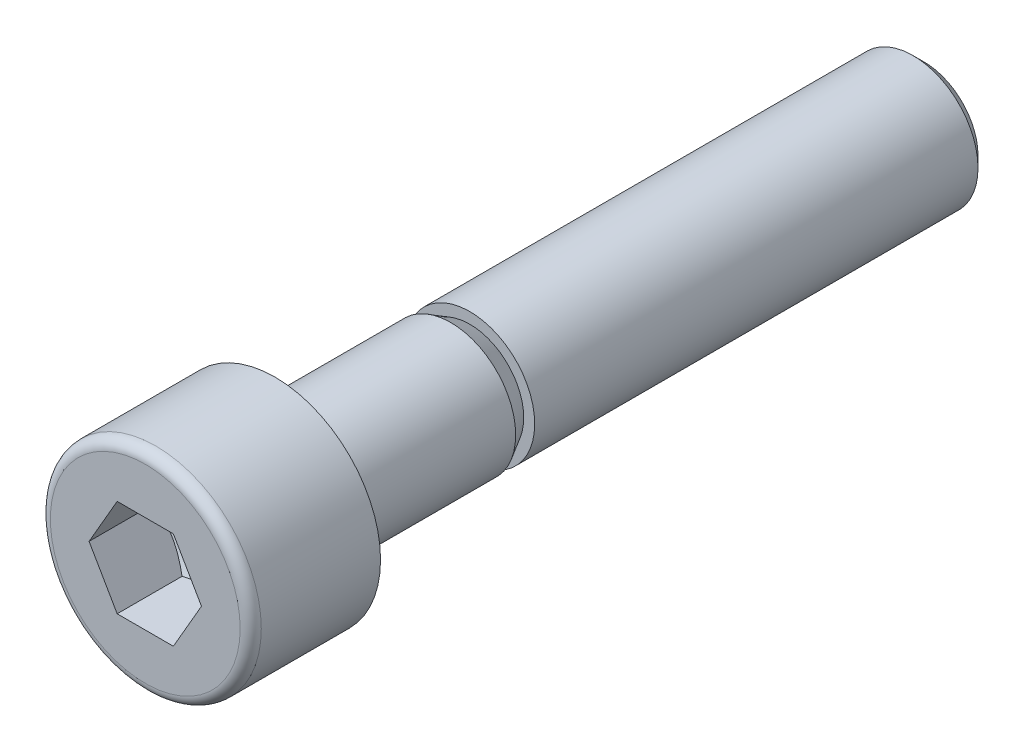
ISO-10303-21;
HEADER;
FILE_DESCRIPTION(('STEP AP214'),'2;1');
FILE_NAME('part.step','',(''),(''),'','','');
FILE_SCHEMA(('AUTOMOTIVE_DESIGN { 1 0 10303 214 1 1 1 1 }'));
ENDSEC;
DATA;
#1=APPLICATION_CONTEXT('core data for automotive mechanical design processes');
#2=APPLICATION_PROTOCOL_DEFINITION('international standard','automotive_design',2000,#1);
#3=PRODUCT_CONTEXT('',#1,'mechanical');
#4=PRODUCT('Part','Part','',(#3));
#5=PRODUCT_RELATED_PRODUCT_CATEGORY('part','',(#4));
#6=PRODUCT_DEFINITION_FORMATION('','',#4);
#7=PRODUCT_DEFINITION_CONTEXT('part definition',#1,'design');
#8=PRODUCT_DEFINITION('design','',#6,#7);
#9=PRODUCT_DEFINITION_SHAPE('','',#8);
#10=(LENGTH_UNIT() NAMED_UNIT(*) SI_UNIT(.MILLI.,.METRE.));
#11=(NAMED_UNIT(*) PLANE_ANGLE_UNIT() SI_UNIT($,.RADIAN.));
#12=(NAMED_UNIT(*) SI_UNIT($,.STERADIAN.) SOLID_ANGLE_UNIT());
#13=UNCERTAINTY_MEASURE_WITH_UNIT(LENGTH_MEASURE(1.E-05),#10,'distance_accuracy_value','');
#14=(GEOMETRIC_REPRESENTATION_CONTEXT(3) GLOBAL_UNCERTAINTY_ASSIGNED_CONTEXT((#13)) GLOBAL_UNIT_ASSIGNED_CONTEXT((#10,
#11,#12)) REPRESENTATION_CONTEXT('',''));
#15=CARTESIAN_POINT('',(0.,0.,0.));
#16=DIRECTION('',(0.,0.,1.));
#17=DIRECTION('',(1.,0.,0.));
#18=AXIS2_PLACEMENT_3D('',#15,#16,#17);
#19=CARTESIAN_POINT('',(0.,0.,8.));
#20=DIRECTION('',(0.,0.,1.));
#21=DIRECTION('',(1.,0.,0.));
#22=AXIS2_PLACEMENT_3D('',#19,#20,#21);
#23=PLANE('',#22);
#24=CARTESIAN_POINT('',(0.,0.,8.));
#25=DIRECTION('',(0.,0.,1.));
#26=DIRECTION('',(1.,0.,0.));
#27=AXIS2_PLACEMENT_3D('',#24,#25,#26);
#28=CIRCLE('',#27,5.85);
#29=CARTESIAN_POINT('',(5.85,0.,8.));
#30=VERTEX_POINT('',#29);
#31=EDGE_CURVE('E137',#30,#30,#28,.T.);
#32=ORIENTED_EDGE('',*,*,#31,.T.);
#33=EDGE_LOOP('',(#32));
#34=FACE_BOUND('',#33,.T.);
#35=DIRECTION('',(1.,0.,0.));
#36=VECTOR('',#35,1.);
#37=CARTESIAN_POINT('',(-1.73205,2.99999860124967,8.));
#38=LINE('',#37,#36);
#39=CARTESIAN_POINT('',(-1.73205,2.99999860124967,8.));
#40=VERTEX_POINT('',#39);
#41=CARTESIAN_POINT('',(1.73205,2.99999860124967,8.));
#42=VERTEX_POINT('',#41);
#43=EDGE_CURVE('E116',#40,#42,#38,.T.);
#44=ORIENTED_EDGE('',*,*,#43,.T.);
#45=DIRECTION('',(0.5,-0.866025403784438,0.));
#46=VECTOR('',#45,1.);
#47=CARTESIAN_POINT('',(1.73205,2.99999860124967,8.));
#48=LINE('',#47,#46);
#49=CARTESIAN_POINT('',(3.4641,0.,8.));
#50=VERTEX_POINT('',#49);
#51=EDGE_CURVE('E37',#42,#50,#48,.T.);
#52=ORIENTED_EDGE('',*,*,#51,.T.);
#53=DIRECTION('',(-0.5,-0.866025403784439,0.));
#54=VECTOR('',#53,1.);
#55=CARTESIAN_POINT('',(3.4641,0.,8.));
#56=LINE('',#55,#54);
#57=CARTESIAN_POINT('',(1.73205,-2.99999860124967,8.));
#58=VERTEX_POINT('',#57);
#59=EDGE_CURVE('E378',#50,#58,#56,.T.);
#60=ORIENTED_EDGE('',*,*,#59,.T.);
#61=DIRECTION('',(-1.,0.,0.));
#62=VECTOR('',#61,1.);
#63=CARTESIAN_POINT('',(1.73205,-2.99999860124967,8.));
#64=LINE('',#63,#62);
#65=CARTESIAN_POINT('',(-1.73205,-2.99999860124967,8.));
#66=VERTEX_POINT('',#65);
#67=EDGE_CURVE('E382',#58,#66,#64,.T.);
#68=ORIENTED_EDGE('',*,*,#67,.T.);
#69=DIRECTION('',(-0.5,0.866025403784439,0.));
#70=VECTOR('',#69,1.);
#71=CARTESIAN_POINT('',(-1.73205,-2.99999860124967,8.));
#72=LINE('',#71,#70);
#73=CARTESIAN_POINT('',(-3.4641,0.,8.));
#74=VERTEX_POINT('',#73);
#75=EDGE_CURVE('E386',#66,#74,#72,.T.);
#76=ORIENTED_EDGE('',*,*,#75,.T.);
#77=DIRECTION('',(0.5,0.866025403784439,0.));
#78=VECTOR('',#77,1.);
#79=CARTESIAN_POINT('',(-3.4641,0.,8.));
#80=LINE('',#79,#78);
#81=EDGE_CURVE('E122',#74,#40,#80,.T.);
#82=ORIENTED_EDGE('',*,*,#81,.T.);
#83=EDGE_LOOP('',(#44,#52,#60,#68,#76,#82));
#84=FACE_BOUND('',#83,.T.);
#85=ADVANCED_FACE('F16',(#34,#84),#23,.T.);
#86=CARTESIAN_POINT('',(0.,3.3234375,-40.));
#87=DIRECTION('',(0.,0.,-1.));
#88=DIRECTION('',(-1.,0.,0.));
#89=AXIS2_PLACEMENT_3D('',#86,#87,#88);
#90=PLANE('',#89);
#91=CARTESIAN_POINT('',(0.,0.,-40.));
#92=DIRECTION('',(0.,0.,1.));
#93=DIRECTION('',(1.,0.,0.));
#94=AXIS2_PLACEMENT_3D('',#91,#92,#93);
#95=CIRCLE('',#94,3.3234375);
#96=CARTESIAN_POINT('',(3.3234375,0.,-40.));
#97=VERTEX_POINT('',#96);
#98=EDGE_CURVE('E10',#97,#97,#95,.T.);
#99=ORIENTED_EDGE('',*,*,#98,.F.);
#100=EDGE_LOOP('',(#99));
#101=FACE_BOUND('',#100,.T.);
#102=ADVANCED_FACE('F18',(#101),#90,.T.);
#103=CARTESIAN_POINT('',(0.,0.,-39.3234375));
#104=DIRECTION('',(0.,0.,1.));
#105=DIRECTION('',(1.,0.,0.));
#106=AXIS2_PLACEMENT_3D('',#103,#104,#105);
#107=CONICAL_SURFACE('',#106,4.,0.785398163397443);
#108=ORIENTED_EDGE('',*,*,#98,.T.);
#109=EDGE_LOOP('',(#108));
#110=FACE_BOUND('',#109,.T.);
#111=CARTESIAN_POINT('',(0.,0.,-39.3234375));
#112=DIRECTION('',(0.,0.,1.));
#113=DIRECTION('',(1.,0.,0.));
#114=AXIS2_PLACEMENT_3D('',#111,#112,#113);
#115=CIRCLE('',#114,4.);
#116=CARTESIAN_POINT('',(4.,0.,-39.3234375));
#117=VERTEX_POINT('',#116);
#118=EDGE_CURVE('E25',#117,#117,#115,.T.);
#119=ORIENTED_EDGE('',*,*,#118,.F.);
#120=EDGE_LOOP('',(#119));
#121=FACE_BOUND('',#120,.T.);
#122=ADVANCED_FACE('F177',(#110,#121),#107,.T.);
#123=CARTESIAN_POINT('',(0.,0.,8.));
#124=DIRECTION('',(0.,0.,1.));
#125=DIRECTION('',(1.,0.,0.));
#126=AXIS2_PLACEMENT_3D('',#123,#124,#125);
#127=CYLINDRICAL_SURFACE('',#126,4.);
#128=ORIENTED_EDGE('',*,*,#118,.T.);
#129=EDGE_LOOP('',(#128));
#130=FACE_BOUND('',#129,.T.);
#131=CARTESIAN_POINT('',(0.,0.,-12.));
#132=DIRECTION('',(0.,0.,1.));
#133=DIRECTION('',(1.,0.,0.));
#134=AXIS2_PLACEMENT_3D('',#131,#132,#133);
#135=CIRCLE('',#134,4.);
#136=CARTESIAN_POINT('',(4.,0.,-12.));
#137=VERTEX_POINT('',#136);
#138=EDGE_CURVE('E164',#137,#137,#135,.T.);
#139=ORIENTED_EDGE('',*,*,#138,.F.);
#140=EDGE_LOOP('',(#139));
#141=FACE_BOUND('',#140,.T.);
#142=ADVANCED_FACE('F174',(#130,#141),#127,.T.);
#143=CARTESIAN_POINT('',(0.,3.3234375,-12.));
#144=DIRECTION('',(0.,0.,1.));
#145=DIRECTION('',(1.,0.,0.));
#146=AXIS2_PLACEMENT_3D('',#143,#144,#145);
#147=PLANE('',#146);
#148=ORIENTED_EDGE('',*,*,#138,.T.);
#149=EDGE_LOOP('',(#148));
#150=FACE_BOUND('',#149,.T.);
#151=CARTESIAN_POINT('',(0.,0.,-12.));
#152=DIRECTION('',(0.,0.,1.));
#153=DIRECTION('',(1.,0.,0.));
#154=AXIS2_PLACEMENT_3D('',#151,#152,#153);
#155=CIRCLE('',#154,3.3234375);
#156=CARTESIAN_POINT('',(3.3234375,0.,-12.));
#157=VERTEX_POINT('',#156);
#158=EDGE_CURVE('E160',#157,#157,#155,.T.);
#159=ORIENTED_EDGE('',*,*,#158,.F.);
#160=EDGE_LOOP('',(#159));
#161=FACE_BOUND('',#160,.T.);
#162=ADVANCED_FACE('F185',(#150,#161),#147,.T.);
#163=CARTESIAN_POINT('',(0.,0.,-10.8281593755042));
#164=DIRECTION('',(0.,0.,1.));
#165=DIRECTION('',(1.,0.,0.));
#166=AXIS2_PLACEMENT_3D('',#163,#164,#165);
#167=CONICAL_SURFACE('',#166,4.,0.523598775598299);
#168=ORIENTED_EDGE('',*,*,#158,.T.);
#169=EDGE_LOOP('',(#168));
#170=FACE_BOUND('',#169,.T.);
#171=CARTESIAN_POINT('',(0.,0.,-10.8281593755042));
#172=DIRECTION('',(0.,0.,1.));
#173=DIRECTION('',(1.,0.,0.));
#174=AXIS2_PLACEMENT_3D('',#171,#172,#173);
#175=CIRCLE('',#174,4.);
#176=CARTESIAN_POINT('',(4.,0.,-10.8281593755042));
#177=VERTEX_POINT('',#176);
#178=EDGE_CURVE('E156',#177,#177,#175,.T.);
#179=ORIENTED_EDGE('',*,*,#178,.F.);
#180=EDGE_LOOP('',(#179));
#181=FACE_BOUND('',#180,.T.);
#182=ADVANCED_FACE('F217',(#170,#181),#167,.T.);
#183=CARTESIAN_POINT('',(0.,0.,8.));
#184=DIRECTION('',(0.,0.,1.));
#185=DIRECTION('',(1.,0.,0.));
#186=AXIS2_PLACEMENT_3D('',#183,#184,#185);
#187=CYLINDRICAL_SURFACE('',#186,4.);
#188=ORIENTED_EDGE('',*,*,#178,.T.);
#189=EDGE_LOOP('',(#188));
#190=FACE_BOUND('',#189,.T.);
#191=CARTESIAN_POINT('',(0.,0.,-0.4));
#192=DIRECTION('',(0.,0.,1.));
#193=DIRECTION('',(1.,0.,0.));
#194=AXIS2_PLACEMENT_3D('',#191,#192,#193);
#195=CIRCLE('',#194,4.);
#196=CARTESIAN_POINT('',(4.,0.,-0.4));
#197=VERTEX_POINT('',#196);
#198=EDGE_CURVE('E152',#197,#197,#195,.T.);
#199=ORIENTED_EDGE('',*,*,#198,.F.);
#200=EDGE_LOOP('',(#199));
#201=FACE_BOUND('',#200,.T.);
#202=ADVANCED_FACE('F213',(#190,#201),#187,.T.);
#203=CARTESIAN_POINT('',(0.,0.,-0.4));
#204=DIRECTION('',(0.,0.,1.));
#205=DIRECTION('',(1.,0.,0.));
#206=AXIS2_PLACEMENT_3D('',#203,#204,#205);
#207=TOROIDAL_SURFACE('',#206,4.4,0.4);
#208=ORIENTED_EDGE('',*,*,#198,.T.);
#209=EDGE_LOOP('',(#208));
#210=FACE_BOUND('',#209,.T.);
#211=CARTESIAN_POINT('',(0.,0.,0.));
#212=DIRECTION('',(0.,0.,1.));
#213=DIRECTION('',(1.,0.,0.));
#214=AXIS2_PLACEMENT_3D('',#211,#212,#213);
#215=CIRCLE('',#214,4.4);
#216=CARTESIAN_POINT('',(4.4,0.,0.));
#217=VERTEX_POINT('',#216);
#218=EDGE_CURVE('E148',#217,#217,#215,.T.);
#219=ORIENTED_EDGE('',*,*,#218,.F.);
#220=EDGE_LOOP('',(#219));
#221=FACE_BOUND('',#220,.T.);
#222=ADVANCED_FACE('F209',(#210,#221),#207,.F.);
#223=CARTESIAN_POINT('',(0.,6.5,0.));
#224=DIRECTION('',(0.,0.,-1.));
#225=DIRECTION('',(-1.,0.,0.));
#226=AXIS2_PLACEMENT_3D('',#223,#224,#225);
#227=PLANE('',#226);
#228=ORIENTED_EDGE('',*,*,#218,.T.);
#229=EDGE_LOOP('',(#228));
#230=FACE_BOUND('',#229,.T.);
#231=CARTESIAN_POINT('',(0.,0.,0.));
#232=DIRECTION('',(0.,0.,1.));
#233=DIRECTION('',(1.,0.,0.));
#234=AXIS2_PLACEMENT_3D('',#231,#232,#233);
#235=CIRCLE('',#234,6.5);
#236=CARTESIAN_POINT('',(6.5,0.,0.));
#237=VERTEX_POINT('',#236);
#238=EDGE_CURVE('E144',#237,#237,#235,.T.);
#239=ORIENTED_EDGE('',*,*,#238,.F.);
#240=EDGE_LOOP('',(#239));
#241=FACE_BOUND('',#240,.T.);
#242=ADVANCED_FACE('F205',(#230,#241),#227,.T.);
#243=CARTESIAN_POINT('',(0.,0.,8.));
#244=DIRECTION('',(0.,0.,1.));
#245=DIRECTION('',(1.,0.,0.));
#246=AXIS2_PLACEMENT_3D('',#243,#244,#245);
#247=CYLINDRICAL_SURFACE('',#246,6.5);
#248=ORIENTED_EDGE('',*,*,#238,.T.);
#249=EDGE_LOOP('',(#248));
#250=FACE_BOUND('',#249,.T.);
#251=CARTESIAN_POINT('',(0.,0.,7.35));
#252=DIRECTION('',(0.,0.,1.));
#253=DIRECTION('',(1.,0.,0.));
#254=AXIS2_PLACEMENT_3D('',#251,#252,#253);
#255=CIRCLE('',#254,6.5);
#256=CARTESIAN_POINT('',(6.5,0.,7.35));
#257=VERTEX_POINT('',#256);
#258=EDGE_CURVE('E140',#257,#257,#255,.T.);
#259=ORIENTED_EDGE('',*,*,#258,.F.);
#260=EDGE_LOOP('',(#259));
#261=FACE_BOUND('',#260,.T.);
#262=ADVANCED_FACE('F201',(#250,#261),#247,.T.);
#263=CARTESIAN_POINT('',(0.,0.,7.35));
#264=DIRECTION('',(0.,0.,1.));
#265=DIRECTION('',(1.,0.,0.));
#266=AXIS2_PLACEMENT_3D('',#263,#264,#265);
#267=TOROIDAL_SURFACE('',#266,5.85,0.65);
#268=ORIENTED_EDGE('',*,*,#31,.F.);
#269=EDGE_LOOP('',(#268));
#270=FACE_BOUND('',#269,.T.);
#271=ORIENTED_EDGE('',*,*,#258,.T.);
#272=EDGE_LOOP('',(#271));
#273=FACE_BOUND('',#272,.T.);
#274=ADVANCED_FACE('F198',(#270,#273),#267,.T.);
#275=CARTESIAN_POINT('',(1.73205,2.99999860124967,2.00000093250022));
#276=DIRECTION('',(-0.866025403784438,-0.5,0.));
#277=DIRECTION('',(-0.5,0.866025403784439,0.));
#278=AXIS2_PLACEMENT_3D('',#275,#276,#277);
#279=PLANE('',#278);
#280=DIRECTION('',(0.,0.,1.));
#281=VECTOR('',#280,1.);
#282=CARTESIAN_POINT('',(3.4641,0.,2.00000093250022));
#283=LINE('',#282,#281);
#284=CARTESIAN_POINT('',(3.4641,0.,4.));
#285=VERTEX_POINT('',#284);
#286=EDGE_CURVE('E134',#285,#50,#283,.T.);
#287=ORIENTED_EDGE('',*,*,#286,.T.);
#288=ORIENTED_EDGE('',*,*,#51,.F.);
#289=DIRECTION('',(0.,0.,1.));
#290=VECTOR('',#289,1.);
#291=CARTESIAN_POINT('',(1.73205,2.99999860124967,2.00000093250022));
#292=LINE('',#291,#290);
#293=CARTESIAN_POINT('',(1.73205,2.99999860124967,4.));
#294=VERTEX_POINT('',#293);
#295=EDGE_CURVE('E109',#294,#42,#292,.T.);
#296=ORIENTED_EDGE('',*,*,#295,.F.);
#297=CARTESIAN_POINT('',(3.46410115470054,-2.E-06,4.000000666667));
#298=CARTESIAN_POINT('',(3.38798802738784,0.13182980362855,3.95604395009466));
#299=CARTESIAN_POINT('',(3.3112178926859,0.264799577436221,3.91606760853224));
#300=CARTESIAN_POINT('',(3.15634839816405,0.533041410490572,3.84629008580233));
#301=CARTESIAN_POINT('',(3.07824628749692,0.668318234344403,3.81651358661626));
#302=CARTESIAN_POINT('',(2.92300994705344,0.937195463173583,3.77016429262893));
#303=CARTESIAN_POINT('',(2.84589959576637,1.07075450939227,3.75328298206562));
#304=CARTESIAN_POINT('',(2.69131625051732,1.33850071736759,3.73313394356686));
#305=CARTESIAN_POINT('',(2.61384381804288,1.47268690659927,3.72984952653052));
#306=CARTESIAN_POINT('',(2.46909473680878,1.72339966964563,3.73669947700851));
#307=CARTESIAN_POINT('',(2.40179636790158,1.83996386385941,3.7451519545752));
#308=CARTESIAN_POINT('',(2.26763805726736,2.0723328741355,3.77193599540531));
#309=CARTESIAN_POINT('',(2.20077857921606,2.18813688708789,3.79027669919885));
#310=CARTESIAN_POINT('',(2.06634388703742,2.42098460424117,3.83612493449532));
#311=CARTESIAN_POINT('',(1.99878567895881,2.53799885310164,3.86382672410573));
#312=CARTESIAN_POINT('',(1.86467660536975,2.77028258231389,3.92669808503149));
#313=CARTESIAN_POINT('',(1.7981240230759,2.88555503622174,3.96185289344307));
#314=CARTESIAN_POINT('',(1.73204884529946,3.00000060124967,4.000000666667));
#315=B_SPLINE_CURVE_WITH_KNOTS('',3,(#297,#298,#299,#300,#301,#302,#303,#304,#305,#306,#307,
#308,#309,#310,#311,#312,#313,#314),.UNSPECIFIED.,.F.,.F.,(4,2,2,2,2,2,2,2,4),(0.,
0.475523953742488,0.952190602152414,1.41706121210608,1.88136106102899,2.28556223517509,
2.69013768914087,3.10368471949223,3.51642012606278),.UNSPECIFIED.);
#316=EDGE_CURVE('E101',#285,#294,#315,.T.);
#317=ORIENTED_EDGE('',*,*,#316,.F.);
#318=EDGE_LOOP('',(#287,#288,#296,#317));
#319=FACE_BOUND('',#318,.T.);
#320=ADVANCED_FACE('F110',(#319),#279,.T.);
#321=CARTESIAN_POINT('',(3.4641,0.,2.00000093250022));
#322=DIRECTION('',(-0.866025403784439,0.5,0.));
#323=DIRECTION('',(0.5,0.866025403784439,0.));
#324=AXIS2_PLACEMENT_3D('',#321,#322,#323);
#325=PLANE('',#324);
#326=DIRECTION('',(0.,0.,1.));
#327=VECTOR('',#326,1.);
#328=CARTESIAN_POINT('',(1.73205,-2.99999860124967,2.00000093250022));
#329=LINE('',#328,#327);
#330=CARTESIAN_POINT('',(1.73205,-2.99999860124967,4.));
#331=VERTEX_POINT('',#330);
#332=EDGE_CURVE('E131',#331,#58,#329,.T.);
#333=ORIENTED_EDGE('',*,*,#332,.T.);
#334=ORIENTED_EDGE('',*,*,#59,.F.);
#335=ORIENTED_EDGE('',*,*,#286,.F.);
#336=CARTESIAN_POINT('',(1.73204884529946,-3.00000060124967,4.000000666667));
#337=CARTESIAN_POINT('',(1.80816197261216,-2.86816879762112,3.95604395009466));
#338=CARTESIAN_POINT('',(1.8849321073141,-2.73519902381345,3.91606760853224));
#339=CARTESIAN_POINT('',(2.03980160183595,-2.4669571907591,3.84629008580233));
#340=CARTESIAN_POINT('',(2.11790371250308,-2.33168036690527,3.81651358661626));
#341=CARTESIAN_POINT('',(2.27314005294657,-2.06280313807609,3.77016429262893));
#342=CARTESIAN_POINT('',(2.35025040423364,-1.9292440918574,3.75328298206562));
#343=CARTESIAN_POINT('',(2.50483374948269,-1.66149788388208,3.73313394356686));
#344=CARTESIAN_POINT('',(2.58230618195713,-1.52731169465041,3.72984952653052));
#345=CARTESIAN_POINT('',(2.72705526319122,-1.27659893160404,3.73669947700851));
#346=CARTESIAN_POINT('',(2.79435363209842,-1.16003473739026,3.7451519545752));
#347=CARTESIAN_POINT('',(2.92851194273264,-0.927665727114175,3.77193599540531));
#348=CARTESIAN_POINT('',(2.99537142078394,-0.811861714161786,3.79027669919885));
#349=CARTESIAN_POINT('',(3.12980611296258,-0.579013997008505,3.83612493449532));
#350=CARTESIAN_POINT('',(3.1973643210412,-0.46199974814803,3.86382672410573));
#351=CARTESIAN_POINT('',(3.33147339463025,-0.229716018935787,3.92669808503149));
#352=CARTESIAN_POINT('',(3.3980259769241,-0.114443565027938,3.96185289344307));
#353=CARTESIAN_POINT('',(3.46410115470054,2.00000000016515E-06,4.000000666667));
#354=B_SPLINE_CURVE_WITH_KNOTS('',3,(#336,#337,#338,#339,#340,#341,#342,#343,#344,#345,#346,
#347,#348,#349,#350,#351,#352,#353),.UNSPECIFIED.,.F.,.F.,(4,2,2,2,2,2,2,2,4),(0.,
0.475523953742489,0.952190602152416,1.41706121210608,1.88136106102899,2.28556223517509,
2.69013768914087,3.10368471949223,3.51642012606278),.UNSPECIFIED.);
#355=EDGE_CURVE('E105',#331,#285,#354,.T.);
#356=ORIENTED_EDGE('',*,*,#355,.F.);
#357=EDGE_LOOP('',(#333,#334,#335,#356));
#358=FACE_BOUND('',#357,.T.);
#359=ADVANCED_FACE('F282',(#358),#325,.T.);
#360=CARTESIAN_POINT('',(1.73205,-2.99999860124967,2.00000093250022));
#361=DIRECTION('',(0.,1.,0.));
#362=DIRECTION('',(1.,0.,0.));
#363=AXIS2_PLACEMENT_3D('',#360,#361,#362);
#364=PLANE('',#363);
#365=DIRECTION('',(0.,0.,1.));
#366=VECTOR('',#365,1.);
#367=CARTESIAN_POINT('',(-1.73205,-2.99999860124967,2.00000093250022));
#368=LINE('',#367,#366);
#369=CARTESIAN_POINT('',(-1.73205,-2.99999860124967,4.));
#370=VERTEX_POINT('',#369);
#371=EDGE_CURVE('E128',#370,#66,#368,.T.);
#372=ORIENTED_EDGE('',*,*,#371,.T.);
#373=ORIENTED_EDGE('',*,*,#67,.F.);
#374=ORIENTED_EDGE('',*,*,#332,.F.);
#375=CARTESIAN_POINT('',(-4.48543327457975,-2.99999860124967,5.11550534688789));
#376=CARTESIAN_POINT('',(-4.35588300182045,-2.99999860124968,5.05335202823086));
#377=CARTESIAN_POINT('',(-4.22601712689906,-2.99999860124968,4.99184428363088));
#378=CARTESIAN_POINT('',(-3.9654859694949,-2.99999860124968,4.87048616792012));
#379=CARTESIAN_POINT('',(-3.8348205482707,-2.99999860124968,4.81063609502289));
#380=CARTESIAN_POINT('',(-3.57177288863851,-2.99999860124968,4.69262519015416));
#381=CARTESIAN_POINT('',(-3.43938504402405,-2.99999860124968,4.63447680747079));
#382=CARTESIAN_POINT('',(-3.17349843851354,-2.99999860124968,4.52078755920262));
#383=CARTESIAN_POINT('',(-3.03999973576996,-2.99999860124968,4.46524655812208));
#384=CARTESIAN_POINT('',(-2.768162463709,-2.99999860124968,4.356052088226));
#385=CARTESIAN_POINT('',(-2.6297886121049,-2.99999860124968,4.30248593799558));
#386=CARTESIAN_POINT('',(-2.35136718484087,-2.99999860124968,4.19980717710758));
#387=CARTESIAN_POINT('',(-2.21131941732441,-2.99999860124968,4.15069508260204));
#388=CARTESIAN_POINT('',(-1.92964461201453,-2.99999860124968,4.0583268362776));
#389=CARTESIAN_POINT('',(-1.78802198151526,-2.99999860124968,4.01505738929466));
#390=CARTESIAN_POINT('',(-1.5027595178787,-2.99999860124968,3.93586037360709));
#391=CARTESIAN_POINT('',(-1.35912038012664,-2.99999860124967,3.89993033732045));
#392=CARTESIAN_POINT('',(-1.07010555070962,-2.99999860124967,3.83732117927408));
#393=CARTESIAN_POINT('',(-0.924733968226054,-2.99999860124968,3.81062345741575));
#394=CARTESIAN_POINT('',(-0.632364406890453,-2.99999860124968,3.76822932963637));
#395=CARTESIAN_POINT('',(-0.485366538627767,-2.99999860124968,3.75253218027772));
#396=CARTESIAN_POINT('',(-0.192319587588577,-2.99999860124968,3.73359558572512));
#397=CARTESIAN_POINT('',(-0.0462802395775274,-2.99999860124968,3.7302091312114));
#398=CARTESIAN_POINT('',(0.245570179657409,-2.99999860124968,3.73580306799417));
#399=CARTESIAN_POINT('',(0.391381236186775,-2.99999860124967,3.74478422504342));
#400=CARTESIAN_POINT('',(0.643868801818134,-2.99999860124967,3.77043931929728));
#401=CARTESIAN_POINT('',(0.750824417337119,-2.99999860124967,3.78449289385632));
#402=CARTESIAN_POINT('',(0.963839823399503,-2.99999860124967,3.81828752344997));
#403=CARTESIAN_POINT('',(1.06989946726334,-2.99999860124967,3.83802949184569));
#404=CARTESIAN_POINT('',(1.3866523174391,-2.99999860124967,3.90473774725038));
#405=CARTESIAN_POINT('',(1.59578448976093,-2.99999860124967,3.95917098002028));
#406=CARTESIAN_POINT('',(1.90847464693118,-2.99999860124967,4.05215904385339));
#407=CARTESIAN_POINT('',(2.01368123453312,-2.99999860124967,4.08547388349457));
#408=CARTESIAN_POINT('',(2.2230712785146,-2.99999860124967,4.15520553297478));
#409=CARTESIAN_POINT('',(2.32725472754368,-2.99999860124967,4.19162236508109));
#410=CARTESIAN_POINT('',(2.5346401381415,-2.99999860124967,4.26700365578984));
#411=CARTESIAN_POINT('',(2.63784247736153,-2.99999860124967,4.30596708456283));
#412=CARTESIAN_POINT('',(2.84341531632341,-2.99999860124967,4.38601920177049));
#413=CARTESIAN_POINT('',(2.94578582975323,-2.99999860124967,4.42710785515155));
#414=CARTESIAN_POINT('',(3.20709884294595,-2.99999860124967,4.53462485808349));
#415=CARTESIAN_POINT('',(3.36551842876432,-2.99999860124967,4.60232247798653));
#416=CARTESIAN_POINT('',(3.68093034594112,-2.99999860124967,4.74097446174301));
#417=CARTESIAN_POINT('',(3.83792256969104,-2.99999860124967,4.81192906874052));
#418=CARTESIAN_POINT('',(4.15078503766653,-2.99999860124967,4.95636011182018));
#419=CARTESIAN_POINT('',(4.30665500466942,-2.99999860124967,5.02983714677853));
#420=CARTESIAN_POINT('',(4.61745618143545,-2.99999860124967,5.17875357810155));
#421=CARTESIAN_POINT('',(4.77238737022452,-2.99999860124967,5.25419301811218));
#422=CARTESIAN_POINT('',(5.23640418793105,-2.99999860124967,5.48299928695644));
#423=CARTESIAN_POINT('',(5.54434659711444,-2.99999860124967,5.63868235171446));
#424=CARTESIAN_POINT('',(6.15811770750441,-2.99999860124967,5.95402735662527));
#425=CARTESIAN_POINT('',(6.46394670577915,-2.99999860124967,6.11368872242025));
#426=CARTESIAN_POINT('',(7.04534872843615,-2.99999860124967,6.42057520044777));
#427=CARTESIAN_POINT('',(7.32105311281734,-2.99999860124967,6.5675518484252));
#428=CARTESIAN_POINT('',(7.8715766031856,-2.99999860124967,6.86317929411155));
#429=CARTESIAN_POINT('',(8.14639567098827,-2.99999860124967,7.01183016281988));
#430=CARTESIAN_POINT('',(8.69465235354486,-2.99999860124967,7.31000721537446));
#431=CARTESIAN_POINT('',(8.96809170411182,-2.99999860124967,7.45953021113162));
#432=CARTESIAN_POINT('',(9.51441609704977,-2.99999860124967,7.75954857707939));
#433=CARTESIAN_POINT('',(9.7873011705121,-2.99999860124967,7.9100438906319));
#434=CARTESIAN_POINT('',(10.0599876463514,-2.99999860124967,8.06089588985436));
#435=B_SPLINE_CURVE_WITH_KNOTS('',3,(#375,#376,#377,#378,#379,#380,#381,#382,#383,#384,#385,
#386,#387,#388,#389,#390,#391,#392,#393,#394,#395,#396,#397,#398,#399,#400,#401,#402,#403,#404,
#405,#406,#407,#408,#409,#410,#411,#412,#413,#414,#415,#416,#417,#418,#419,#420,#421,#422,#423,
#424,#425,#426,#427,#428,#429,#430,#431,#432,#433,#434),.UNSPECIFIED.,.F.,.F.,(4,2,2,2,2,2,2,2,
2,2,2,2,2,2,2,2,2,2,2,2,2,2,2,2,2,2,2,2,2,4),(0.,0.431070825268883,0.862218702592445,
1.29598193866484,1.72972260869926,2.17480373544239,2.6199363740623,3.0640383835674,
3.50799083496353,3.95104358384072,4.39406638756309,4.83178108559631,5.2695228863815,
5.59298785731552,5.91650479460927,6.56394435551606,6.89498708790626,7.2260321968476,
7.55694425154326,7.88785084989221,8.40463219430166,8.92145218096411,9.43839573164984,
9.9553507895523,10.9904747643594,12.0254501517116,12.9627445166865,13.9000787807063,
14.8350289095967,15.7699250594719),.UNSPECIFIED.);
#436=EDGE_CURVE('E343',#370,#331,#435,.T.);
#437=ORIENTED_EDGE('',*,*,#436,.F.);
#438=EDGE_LOOP('',(#372,#373,#374,#437));
#439=FACE_BOUND('',#438,.T.);
#440=ADVANCED_FACE('F289',(#439),#364,.T.);
#441=CARTESIAN_POINT('',(-1.73205,-2.99999860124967,2.00000093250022));
#442=DIRECTION('',(0.866025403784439,0.5,0.));
#443=DIRECTION('',(0.5,-0.866025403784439,0.));
#444=AXIS2_PLACEMENT_3D('',#441,#442,#443);
#445=PLANE('',#444);
#446=DIRECTION('',(0.,0.,1.));
#447=VECTOR('',#446,1.);
#448=CARTESIAN_POINT('',(-3.4641,0.,2.00000093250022));
#449=LINE('',#448,#447);
#450=CARTESIAN_POINT('',(-3.4641,0.,4.));
#451=VERTEX_POINT('',#450);
#452=EDGE_CURVE('E119',#451,#74,#449,.T.);
#453=ORIENTED_EDGE('',*,*,#452,.T.);
#454=ORIENTED_EDGE('',*,*,#75,.F.);
#455=ORIENTED_EDGE('',*,*,#371,.F.);
#456=CARTESIAN_POINT('',(-3.46410115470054,2.E-06,4.000000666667));
#457=CARTESIAN_POINT('',(-3.38798802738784,-0.131829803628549,3.95604395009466));
#458=CARTESIAN_POINT('',(-3.3112178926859,-0.26479957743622,3.91606760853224));
#459=CARTESIAN_POINT('',(-3.15634839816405,-0.533041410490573,3.84629008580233));
#460=CARTESIAN_POINT('',(-3.07824628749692,-0.668318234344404,3.81651358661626));
#461=CARTESIAN_POINT('',(-2.92300994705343,-0.937195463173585,3.77016429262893));
#462=CARTESIAN_POINT('',(-2.84589959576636,-1.07075450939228,3.75328298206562));
#463=CARTESIAN_POINT('',(-2.69131625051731,-1.33850071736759,3.73313394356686));
#464=CARTESIAN_POINT('',(-2.61384381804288,-1.47268690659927,3.72984952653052));
#465=CARTESIAN_POINT('',(-2.46909473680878,-1.72339966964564,3.73669947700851));
#466=CARTESIAN_POINT('',(-2.40179636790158,-1.83996386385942,3.7451519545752));
#467=CARTESIAN_POINT('',(-2.26763805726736,-2.0723328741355,3.77193599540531));
#468=CARTESIAN_POINT('',(-2.20077857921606,-2.18813688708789,3.79027669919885));
#469=CARTESIAN_POINT('',(-2.06634388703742,-2.42098460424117,3.83612493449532));
#470=CARTESIAN_POINT('',(-1.9987856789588,-2.53799885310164,3.86382672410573));
#471=CARTESIAN_POINT('',(-1.86467660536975,-2.77028258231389,3.92669808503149));
#472=CARTESIAN_POINT('',(-1.7981240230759,-2.88555503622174,3.96185289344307));
#473=CARTESIAN_POINT('',(-1.73204884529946,-3.00000060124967,4.000000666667));
#474=B_SPLINE_CURVE_WITH_KNOTS('',3,(#456,#457,#458,#459,#460,#461,#462,#463,#464,#465,#466,
#467,#468,#469,#470,#471,#472,#473),.UNSPECIFIED.,.F.,.F.,(4,2,2,2,2,2,2,2,4),(0.,
0.47552395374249,0.952190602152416,1.41706121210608,1.88136106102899,2.28556223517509,
2.69013768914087,3.10368471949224,3.51642012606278),.UNSPECIFIED.);
#475=EDGE_CURVE('E339',#451,#370,#474,.T.);
#476=ORIENTED_EDGE('',*,*,#475,.F.);
#477=EDGE_LOOP('',(#453,#454,#455,#476));
#478=FACE_BOUND('',#477,.T.);
#479=ADVANCED_FACE('F297',(#478),#445,.T.);
#480=CARTESIAN_POINT('',(-3.4641,0.,2.00000093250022));
#481=DIRECTION('',(0.866025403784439,-0.5,0.));
#482=DIRECTION('',(-0.5,-0.866025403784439,0.));
#483=AXIS2_PLACEMENT_3D('',#480,#481,#482);
#484=PLANE('',#483);
#485=DIRECTION('',(0.,0.,1.));
#486=VECTOR('',#485,1.);
#487=CARTESIAN_POINT('',(-1.73205,2.99999860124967,2.00000093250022));
#488=LINE('',#487,#486);
#489=CARTESIAN_POINT('',(-1.73205,2.99999860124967,4.));
#490=VERTEX_POINT('',#489);
#491=EDGE_CURVE('E115',#490,#40,#488,.T.);
#492=ORIENTED_EDGE('',*,*,#491,.T.);
#493=ORIENTED_EDGE('',*,*,#81,.F.);
#494=ORIENTED_EDGE('',*,*,#452,.F.);
#495=CARTESIAN_POINT('',(-1.73204884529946,3.00000060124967,4.000000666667));
#496=CARTESIAN_POINT('',(-1.80816197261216,2.86816879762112,3.95604395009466));
#497=CARTESIAN_POINT('',(-1.8849321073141,2.73519902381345,3.91606760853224));
#498=CARTESIAN_POINT('',(-2.03980160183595,2.4669571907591,3.84629008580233));
#499=CARTESIAN_POINT('',(-2.11790371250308,2.33168036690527,3.81651358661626));
#500=CARTESIAN_POINT('',(-2.27314005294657,2.06280313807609,3.77016429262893));
#501=CARTESIAN_POINT('',(-2.35025040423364,1.9292440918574,3.75328298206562));
#502=CARTESIAN_POINT('',(-2.50483374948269,1.66149788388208,3.73313394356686));
#503=CARTESIAN_POINT('',(-2.58230618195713,1.52731169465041,3.72984952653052));
#504=CARTESIAN_POINT('',(-2.72705526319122,1.27659893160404,3.73669947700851));
#505=CARTESIAN_POINT('',(-2.79435363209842,1.16003473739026,3.7451519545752));
#506=CARTESIAN_POINT('',(-2.92851194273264,0.927665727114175,3.77193599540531));
#507=CARTESIAN_POINT('',(-2.99537142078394,0.811861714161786,3.79027669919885));
#508=CARTESIAN_POINT('',(-3.12980611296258,0.579013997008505,3.83612493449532));
#509=CARTESIAN_POINT('',(-3.1973643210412,0.46199974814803,3.86382672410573));
#510=CARTESIAN_POINT('',(-3.33147339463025,0.229716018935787,3.92669808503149));
#511=CARTESIAN_POINT('',(-3.3980259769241,0.114443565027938,3.96185289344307));
#512=CARTESIAN_POINT('',(-3.46410115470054,-1.9999999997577E-06,4.000000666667));
#513=B_SPLINE_CURVE_WITH_KNOTS('',3,(#495,#496,#497,#498,#499,#500,#501,#502,#503,#504,#505,
#506,#507,#508,#509,#510,#511,#512),.UNSPECIFIED.,.F.,.F.,(4,2,2,2,2,2,2,2,4),(0.,
0.47552395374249,0.952190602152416,1.41706121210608,1.88136106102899,2.28556223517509,
2.69013768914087,3.10368471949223,3.51642012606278),.UNSPECIFIED.);
#514=EDGE_CURVE('E49',#490,#451,#513,.T.);
#515=ORIENTED_EDGE('',*,*,#514,.F.);
#516=EDGE_LOOP('',(#492,#493,#494,#515));
#517=FACE_BOUND('',#516,.T.);
#518=ADVANCED_FACE('F306',(#517),#484,.T.);
#519=CARTESIAN_POINT('',(-1.73205,2.99999860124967,2.00000093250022));
#520=DIRECTION('',(0.,-1.,0.));
#521=DIRECTION('',(-1.,0.,0.));
#522=AXIS2_PLACEMENT_3D('',#519,#520,#521);
#523=PLANE('',#522);
#524=ORIENTED_EDGE('',*,*,#295,.T.);
#525=ORIENTED_EDGE('',*,*,#43,.F.);
#526=ORIENTED_EDGE('',*,*,#491,.F.);
#527=CARTESIAN_POINT('',(-4.48543327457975,2.99999860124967,5.11550534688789));
#528=CARTESIAN_POINT('',(-4.35588300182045,2.99999860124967,5.05335202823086));
#529=CARTESIAN_POINT('',(-4.22601712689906,2.99999860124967,4.99184428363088));
#530=CARTESIAN_POINT('',(-3.96548596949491,2.99999860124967,4.87048616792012));
#531=CARTESIAN_POINT('',(-3.8348205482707,2.99999860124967,4.81063609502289));
#532=CARTESIAN_POINT('',(-3.57177288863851,2.99999860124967,4.69262519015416));
#533=CARTESIAN_POINT('',(-3.43938504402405,2.99999860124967,4.63447680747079));
#534=CARTESIAN_POINT('',(-3.17349843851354,2.99999860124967,4.52078755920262));
#535=CARTESIAN_POINT('',(-3.03999973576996,2.99999860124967,4.46524655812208));
#536=CARTESIAN_POINT('',(-2.768162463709,2.99999860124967,4.356052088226));
#537=CARTESIAN_POINT('',(-2.62978861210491,2.99999860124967,4.30248593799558));
#538=CARTESIAN_POINT('',(-2.35136718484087,2.99999860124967,4.19980717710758));
#539=CARTESIAN_POINT('',(-2.21131941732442,2.99999860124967,4.15069508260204));
#540=CARTESIAN_POINT('',(-1.92964461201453,2.99999860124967,4.0583268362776));
#541=CARTESIAN_POINT('',(-1.78802198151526,2.99999860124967,4.01505738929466));
#542=CARTESIAN_POINT('',(-1.5027595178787,2.99999860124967,3.93586037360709));
#543=CARTESIAN_POINT('',(-1.35912038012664,2.99999860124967,3.89993033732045));
#544=CARTESIAN_POINT('',(-1.07010555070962,2.99999860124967,3.83732117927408));
#545=CARTESIAN_POINT('',(-0.924733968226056,2.99999860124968,3.81062345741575));
#546=CARTESIAN_POINT('',(-0.632364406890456,2.99999860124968,3.76822932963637));
#547=CARTESIAN_POINT('',(-0.48536653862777,2.99999860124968,3.75253218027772));
#548=CARTESIAN_POINT('',(-0.19231958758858,2.99999860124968,3.73359558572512));
#549=CARTESIAN_POINT('',(-0.0462802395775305,2.99999860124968,3.7302091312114));
#550=CARTESIAN_POINT('',(0.245570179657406,2.99999860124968,3.73580306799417));
#551=CARTESIAN_POINT('',(0.391381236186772,2.99999860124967,3.74478422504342));
#552=CARTESIAN_POINT('',(0.64386880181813,2.99999860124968,3.77043931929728));
#553=CARTESIAN_POINT('',(0.750824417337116,2.99999860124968,3.78449289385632));
#554=CARTESIAN_POINT('',(0.9638398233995,2.99999860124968,3.81828752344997));
#555=CARTESIAN_POINT('',(1.06989946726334,2.99999860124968,3.83802949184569));
#556=CARTESIAN_POINT('',(1.3866523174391,2.99999860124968,3.90473774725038));
#557=CARTESIAN_POINT('',(1.59578448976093,2.99999860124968,3.95917098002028));
#558=CARTESIAN_POINT('',(1.90847464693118,2.99999860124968,4.05215904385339));
#559=CARTESIAN_POINT('',(2.01368123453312,2.99999860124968,4.08547388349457));
#560=CARTESIAN_POINT('',(2.2230712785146,2.99999860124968,4.15520553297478));
#561=CARTESIAN_POINT('',(2.32725472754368,2.99999860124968,4.19162236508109));
#562=CARTESIAN_POINT('',(2.5346401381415,2.99999860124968,4.26700365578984));
#563=CARTESIAN_POINT('',(2.63784247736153,2.99999860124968,4.30596708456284));
#564=CARTESIAN_POINT('',(2.84341531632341,2.99999860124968,4.38601920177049));
#565=CARTESIAN_POINT('',(2.94578582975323,2.99999860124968,4.42710785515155));
#566=CARTESIAN_POINT('',(3.20709884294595,2.99999860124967,4.53462485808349));
#567=CARTESIAN_POINT('',(3.36551842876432,2.99999860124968,4.60232247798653));
#568=CARTESIAN_POINT('',(3.68093034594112,2.99999860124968,4.74097446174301));
#569=CARTESIAN_POINT('',(3.83792256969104,2.99999860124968,4.81192906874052));
#570=CARTESIAN_POINT('',(4.15078503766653,2.99999860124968,4.95636011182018));
#571=CARTESIAN_POINT('',(4.30665500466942,2.99999860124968,5.02983714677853));
#572=CARTESIAN_POINT('',(4.61745618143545,2.99999860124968,5.17875357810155));
#573=CARTESIAN_POINT('',(4.77238737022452,2.99999860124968,5.25419301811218));
#574=CARTESIAN_POINT('',(5.23640418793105,2.99999860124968,5.48299928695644));
#575=CARTESIAN_POINT('',(5.54434659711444,2.99999860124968,5.63868235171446));
#576=CARTESIAN_POINT('',(6.15811770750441,2.99999860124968,5.95402735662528));
#577=CARTESIAN_POINT('',(6.46394670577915,2.99999860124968,6.11368872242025));
#578=CARTESIAN_POINT('',(7.04534872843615,2.99999860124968,6.42057520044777));
#579=CARTESIAN_POINT('',(7.32105311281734,2.99999860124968,6.5675518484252));
#580=CARTESIAN_POINT('',(7.87157660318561,2.99999860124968,6.86317929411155));
#581=CARTESIAN_POINT('',(8.14639567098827,2.99999860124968,7.01183016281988));
#582=CARTESIAN_POINT('',(8.69465235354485,2.99999860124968,7.31000721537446));
#583=CARTESIAN_POINT('',(8.96809170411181,2.99999860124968,7.45953021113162));
#584=CARTESIAN_POINT('',(9.51441609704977,2.99999860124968,7.75954857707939));
#585=CARTESIAN_POINT('',(9.7873011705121,2.99999860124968,7.9100438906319));
#586=CARTESIAN_POINT('',(10.0599876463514,2.99999860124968,8.06089588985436));
#587=B_SPLINE_CURVE_WITH_KNOTS('',3,(#527,#528,#529,#530,#531,#532,#533,#534,#535,#536,#537,
#538,#539,#540,#541,#542,#543,#544,#545,#546,#547,#548,#549,#550,#551,#552,#553,#554,#555,#556,
#557,#558,#559,#560,#561,#562,#563,#564,#565,#566,#567,#568,#569,#570,#571,#572,#573,#574,#575,
#576,#577,#578,#579,#580,#581,#582,#583,#584,#585,#586),.UNSPECIFIED.,.F.,.F.,(4,2,2,2,2,2,2,2,
2,2,2,2,2,2,2,2,2,2,2,2,2,2,2,2,2,2,2,2,2,4),(0.,0.431070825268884,0.862218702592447,
1.29598193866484,1.72972260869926,2.1748037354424,2.6199363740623,3.06403838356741,
3.50799083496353,3.95104358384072,4.39406638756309,4.83178108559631,5.2695228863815,
5.59298785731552,5.91650479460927,6.56394435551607,6.89498708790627,7.2260321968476,
7.55694425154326,7.88785084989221,8.40463219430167,8.92145218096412,9.43839573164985,
9.9553507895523,10.9904747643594,12.0254501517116,12.9627445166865,13.9000787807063,
14.8350289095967,15.7699250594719),.UNSPECIFIED.);
#588=EDGE_CURVE('E102',#294,#490,#587,.F.);
#589=ORIENTED_EDGE('',*,*,#588,.F.);
#590=EDGE_LOOP('',(#524,#525,#526,#589));
#591=FACE_BOUND('',#590,.T.);
#592=ADVANCED_FACE('F97',(#591),#523,.T.);
#593=CARTESIAN_POINT('',(0.,0.,2.00000093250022));
#594=DIRECTION('',(0.,0.,1.));
#595=DIRECTION('',(1.,0.,0.));
#596=AXIS2_PLACEMENT_3D('',#593,#594,#595);
#597=CONICAL_SURFACE('',#596,0.,1.0471975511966);
#598=CARTESIAN_POINT('',(0.,0.,2.00000093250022));
#599=VERTEX_POINT('',#598);
#600=VERTEX_LOOP('',#599);
#601=FACE_BOUND('',#600,.T.);
#602=ORIENTED_EDGE('',*,*,#316,.T.);
#603=ORIENTED_EDGE('',*,*,#588,.T.);
#604=ORIENTED_EDGE('',*,*,#514,.T.);
#605=ORIENTED_EDGE('',*,*,#475,.T.);
#606=ORIENTED_EDGE('',*,*,#436,.T.);
#607=ORIENTED_EDGE('',*,*,#355,.T.);
#608=EDGE_LOOP('',(#602,#603,#604,#605,#606,#607));
#609=FACE_BOUND('',#608,.T.);
#610=ADVANCED_FACE('F94',(#601,#609),#597,.F.);
#611=CLOSED_SHELL('',(#85,#102,#122,#142,#162,#182,#202,#222,#242,#262,#274,#320,#359,#440,#479,
#518,#592,#610));
#612=MANIFOLD_SOLID_BREP('B1',#611);
#613=ADVANCED_BREP_SHAPE_REPRESENTATION('',(#18,#612),#14);
#614=SHAPE_DEFINITION_REPRESENTATION(#9,#613);
ENDSEC;
END-ISO-10303-21;
